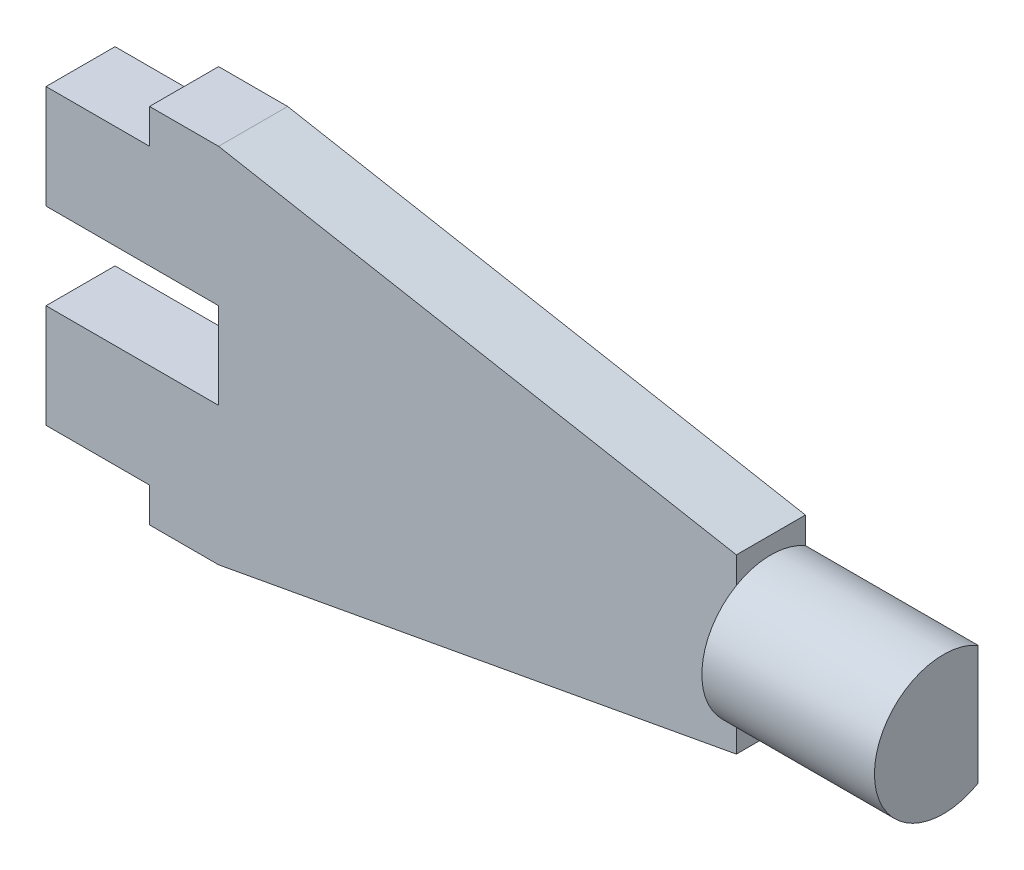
ISO-10303-21;
HEADER;
FILE_DESCRIPTION(('STEP AP214'),'2;1');
FILE_NAME('part.step','',(''),(''),'','','');
FILE_SCHEMA(('AUTOMOTIVE_DESIGN { 1 0 10303 214 1 1 1 1 }'));
ENDSEC;
DATA;
#1=APPLICATION_CONTEXT('core data for automotive mechanical design processes');
#2=APPLICATION_PROTOCOL_DEFINITION('international standard','automotive_design',2000,#1);
#3=PRODUCT_CONTEXT('',#1,'mechanical');
#4=PRODUCT('Part','Part','',(#3));
#5=PRODUCT_RELATED_PRODUCT_CATEGORY('part','',(#4));
#6=PRODUCT_DEFINITION_FORMATION('','',#4);
#7=PRODUCT_DEFINITION_CONTEXT('part definition',#1,'design');
#8=PRODUCT_DEFINITION('design','',#6,#7);
#9=PRODUCT_DEFINITION_SHAPE('','',#8);
#10=(LENGTH_UNIT() NAMED_UNIT(*) SI_UNIT(.MILLI.,.METRE.));
#11=(NAMED_UNIT(*) PLANE_ANGLE_UNIT() SI_UNIT($,.RADIAN.));
#12=(NAMED_UNIT(*) SI_UNIT($,.STERADIAN.) SOLID_ANGLE_UNIT());
#13=UNCERTAINTY_MEASURE_WITH_UNIT(LENGTH_MEASURE(1.E-05),#10,'distance_accuracy_value','');
#14=(GEOMETRIC_REPRESENTATION_CONTEXT(3) GLOBAL_UNCERTAINTY_ASSIGNED_CONTEXT((#13)) GLOBAL_UNIT_ASSIGNED_CONTEXT((#10,
#11,#12)) REPRESENTATION_CONTEXT('',''));
#15=CARTESIAN_POINT('',(0.,0.,0.));
#16=DIRECTION('',(0.,0.,1.));
#17=DIRECTION('',(1.,0.,0.));
#18=AXIS2_PLACEMENT_3D('',#15,#16,#17);
#19=CARTESIAN_POINT('',(25.,2.5,2.));
#20=DIRECTION('',(-1.,0.,0.));
#21=DIRECTION('',(0.,0.,1.));
#22=AXIS2_PLACEMENT_3D('',#19,#20,#21);
#23=PLANE('',#22);
#24=CARTESIAN_POINT('',(25.,0.,1.));
#25=DIRECTION('',(1.,0.,0.));
#26=DIRECTION('',(0.,0.,-1.));
#27=AXIS2_PLACEMENT_3D('',#24,#25,#26);
#28=CIRCLE('',#27,2.);
#29=CARTESIAN_POINT('',(25.,1.73205080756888,0.));
#30=VERTEX_POINT('',#29);
#31=CARTESIAN_POINT('',(25.,-1.73205080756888,0.));
#32=VERTEX_POINT('',#31);
#33=EDGE_CURVE('E171',#30,#32,#28,.T.);
#34=ORIENTED_EDGE('',*,*,#33,.T.);
#35=DIRECTION('',(0.,1.,0.));
#36=VECTOR('',#35,1.);
#37=CARTESIAN_POINT('',(25.,2.5,0.));
#38=LINE('',#37,#36);
#39=EDGE_CURVE('E177',#32,#30,#38,.T.);
#40=ORIENTED_EDGE('',*,*,#39,.T.);
#41=EDGE_LOOP('',(#34,#40));
#42=FACE_BOUND('',#41,.T.);
#43=ADVANCED_FACE('F34',(#42),#23,.F.);
#44=CARTESIAN_POINT('',(0.,0.,0.));
#45=DIRECTION('',(0.,0.,-1.));
#46=DIRECTION('',(-1.,0.,0.));
#47=AXIS2_PLACEMENT_3D('',#44,#45,#46);
#48=PLANE('',#47);
#49=DIRECTION('',(1.,0.,0.));
#50=VECTOR('',#49,1.);
#51=CARTESIAN_POINT('',(20.,-1.73205080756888,0.));
#52=LINE('',#51,#50);
#53=CARTESIAN_POINT('',(20.,-1.73205080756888,0.));
#54=VERTEX_POINT('',#53);
#55=EDGE_CURVE('E166',#54,#32,#52,.T.);
#56=ORIENTED_EDGE('',*,*,#55,.F.);
#57=DIRECTION('',(0.,-1.,0.));
#58=VECTOR('',#57,1.);
#59=CARTESIAN_POINT('',(20.,0.,0.));
#60=LINE('',#59,#58);
#61=CARTESIAN_POINT('',(20.,-2.5,0.));
#62=VERTEX_POINT('',#61);
#63=EDGE_CURVE('E152',#54,#62,#60,.T.);
#64=ORIENTED_EDGE('',*,*,#63,.T.);
#65=DIRECTION('',(0.983606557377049,0.180327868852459,0.));
#66=VECTOR('',#65,1.);
#67=CARTESIAN_POINT('',(5.,-5.25,0.));
#68=LINE('',#67,#66);
#69=CARTESIAN_POINT('',(5.,-5.25,0.));
#70=VERTEX_POINT('',#69);
#71=EDGE_CURVE('E215',#70,#62,#68,.T.);
#72=ORIENTED_EDGE('',*,*,#71,.F.);
#73=DIRECTION('',(1.,0.,0.));
#74=VECTOR('',#73,1.);
#75=CARTESIAN_POINT('',(3.,-5.25,0.));
#76=LINE('',#75,#74);
#77=CARTESIAN_POINT('',(3.,-5.25,0.));
#78=VERTEX_POINT('',#77);
#79=EDGE_CURVE('E251',#78,#70,#76,.T.);
#80=ORIENTED_EDGE('',*,*,#79,.F.);
#81=DIRECTION('',(0.,-1.,0.));
#82=VECTOR('',#81,1.);
#83=CARTESIAN_POINT('',(3.,-4.25,0.));
#84=LINE('',#83,#82);
#85=CARTESIAN_POINT('',(3.,-4.25,0.));
#86=VERTEX_POINT('',#85);
#87=EDGE_CURVE('E249',#86,#78,#84,.T.);
#88=ORIENTED_EDGE('',*,*,#87,.F.);
#89=DIRECTION('',(1.,0.,0.));
#90=VECTOR('',#89,1.);
#91=CARTESIAN_POINT('',(0.,-4.25,0.));
#92=LINE('',#91,#90);
#93=CARTESIAN_POINT('',(0.,-4.25,0.));
#94=VERTEX_POINT('',#93);
#95=EDGE_CURVE('E247',#94,#86,#92,.T.);
#96=ORIENTED_EDGE('',*,*,#95,.F.);
#97=DIRECTION('',(0.,-1.,0.));
#98=VECTOR('',#97,1.);
#99=CARTESIAN_POINT('',(0.,-4.25,0.));
#100=LINE('',#99,#98);
#101=CARTESIAN_POINT('',(0.,-1.25,0.));
#102=VERTEX_POINT('',#101);
#103=EDGE_CURVE('E243',#102,#94,#100,.T.);
#104=ORIENTED_EDGE('',*,*,#103,.F.);
#105=DIRECTION('',(1.,0.,0.));
#106=VECTOR('',#105,1.);
#107=CARTESIAN_POINT('',(0.,-1.25,0.));
#108=LINE('',#107,#106);
#109=CARTESIAN_POINT('',(5.,-1.25,0.));
#110=VERTEX_POINT('',#109);
#111=EDGE_CURVE('E189',#102,#110,#108,.T.);
#112=ORIENTED_EDGE('',*,*,#111,.T.);
#113=DIRECTION('',(0.,1.,0.));
#114=VECTOR('',#113,1.);
#115=CARTESIAN_POINT('',(5.,1.25,0.));
#116=LINE('',#115,#114);
#117=CARTESIAN_POINT('',(5.,1.25,0.));
#118=VERTEX_POINT('',#117);
#119=EDGE_CURVE('E56',#110,#118,#116,.T.);
#120=ORIENTED_EDGE('',*,*,#119,.T.);
#121=DIRECTION('',(-1.,0.,0.));
#122=VECTOR('',#121,1.);
#123=CARTESIAN_POINT('',(0.,1.25,0.));
#124=LINE('',#123,#122);
#125=CARTESIAN_POINT('',(0.,1.25,0.));
#126=VERTEX_POINT('',#125);
#127=EDGE_CURVE('E194',#118,#126,#124,.T.);
#128=ORIENTED_EDGE('',*,*,#127,.T.);
#129=CARTESIAN_POINT('',(0.,4.25,0.));
#130=VERTEX_POINT('',#129);
#131=EDGE_CURVE('E244',#130,#126,#100,.T.);
#132=ORIENTED_EDGE('',*,*,#131,.F.);
#133=DIRECTION('',(-1.,0.,0.));
#134=VECTOR('',#133,1.);
#135=CARTESIAN_POINT('',(0.,4.25,0.));
#136=LINE('',#135,#134);
#137=CARTESIAN_POINT('',(3.,4.25,0.));
#138=VERTEX_POINT('',#137);
#139=EDGE_CURVE('E241',#138,#130,#136,.T.);
#140=ORIENTED_EDGE('',*,*,#139,.F.);
#141=DIRECTION('',(0.,-1.,0.));
#142=VECTOR('',#141,1.);
#143=CARTESIAN_POINT('',(3.,4.25,0.));
#144=LINE('',#143,#142);
#145=CARTESIAN_POINT('',(3.,5.25,0.));
#146=VERTEX_POINT('',#145);
#147=EDGE_CURVE('E239',#146,#138,#144,.T.);
#148=ORIENTED_EDGE('',*,*,#147,.F.);
#149=DIRECTION('',(-1.,0.,0.));
#150=VECTOR('',#149,1.);
#151=CARTESIAN_POINT('',(3.,5.25,0.));
#152=LINE('',#151,#150);
#153=CARTESIAN_POINT('',(5.,5.25,0.));
#154=VERTEX_POINT('',#153);
#155=EDGE_CURVE('E237',#154,#146,#152,.T.);
#156=ORIENTED_EDGE('',*,*,#155,.F.);
#157=DIRECTION('',(-0.983606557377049,0.180327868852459,0.));
#158=VECTOR('',#157,1.);
#159=CARTESIAN_POINT('',(5.,5.25,0.));
#160=LINE('',#159,#158);
#161=CARTESIAN_POINT('',(20.,2.5,0.));
#162=VERTEX_POINT('',#161);
#163=EDGE_CURVE('E235',#162,#154,#160,.T.);
#164=ORIENTED_EDGE('',*,*,#163,.F.);
#165=CARTESIAN_POINT('',(20.,1.73205080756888,0.));
#166=VERTEX_POINT('',#165);
#167=EDGE_CURVE('E163',#162,#166,#60,.T.);
#168=ORIENTED_EDGE('',*,*,#167,.T.);
#169=DIRECTION('',(1.,0.,0.));
#170=VECTOR('',#169,1.);
#171=CARTESIAN_POINT('',(20.,1.73205080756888,0.));
#172=LINE('',#171,#170);
#173=EDGE_CURVE('E178',#166,#30,#172,.T.);
#174=ORIENTED_EDGE('',*,*,#173,.T.);
#175=ORIENTED_EDGE('',*,*,#39,.F.);
#176=EDGE_LOOP('',(#56,#64,#72,#80,#88,#96,#104,#112,#120,#128,#132,#140,#148,#156,#164,#168,
#174,#175));
#177=FACE_BOUND('',#176,.T.);
#178=ADVANCED_FACE('F174',(#177),#48,.T.);
#179=CARTESIAN_POINT('',(20.,-2.5,6.));
#180=DIRECTION('',(1.,0.,0.));
#181=DIRECTION('',(0.,0.,-1.));
#182=AXIS2_PLACEMENT_3D('',#179,#180,#181);
#183=PLANE('',#182);
#184=CARTESIAN_POINT('',(20.,0.,1.));
#185=DIRECTION('',(1.,0.,0.));
#186=DIRECTION('',(0.,0.,-1.));
#187=AXIS2_PLACEMENT_3D('',#184,#185,#186);
#188=CIRCLE('',#187,2.);
#189=CARTESIAN_POINT('',(20.,1.73205080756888,2.));
#190=VERTEX_POINT('',#189);
#191=CARTESIAN_POINT('',(20.,-1.73205080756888,2.));
#192=VERTEX_POINT('',#191);
#193=EDGE_CURVE('E169',#190,#192,#188,.T.);
#194=ORIENTED_EDGE('',*,*,#193,.F.);
#195=DIRECTION('',(0.,-1.,0.));
#196=VECTOR('',#195,1.);
#197=CARTESIAN_POINT('',(20.,-2.5,2.));
#198=LINE('',#197,#196);
#199=EDGE_CURVE('E162',#190,#192,#198,.T.);
#200=ORIENTED_EDGE('',*,*,#199,.T.);
#201=EDGE_LOOP('',(#194,#200));
#202=FACE_BOUND('',#201,.T.);
#203=ADVANCED_FACE('F310',(#202),#183,.F.);
#204=CARTESIAN_POINT('',(0.,0.,2.));
#205=DIRECTION('',(0.,0.,-1.));
#206=DIRECTION('',(-1.,0.,0.));
#207=AXIS2_PLACEMENT_3D('',#204,#205,#206);
#208=PLANE('',#207);
#209=CARTESIAN_POINT('',(20.,2.5,2.));
#210=VERTEX_POINT('',#209);
#211=EDGE_CURVE('E186',#210,#190,#198,.T.);
#212=ORIENTED_EDGE('',*,*,#211,.F.);
#213=DIRECTION('',(-0.983606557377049,0.180327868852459,0.));
#214=VECTOR('',#213,1.);
#215=CARTESIAN_POINT('',(5.,5.25,2.));
#216=LINE('',#215,#214);
#217=CARTESIAN_POINT('',(5.,5.25,2.));
#218=VERTEX_POINT('',#217);
#219=EDGE_CURVE('E212',#210,#218,#216,.T.);
#220=ORIENTED_EDGE('',*,*,#219,.T.);
#221=DIRECTION('',(-1.,0.,0.));
#222=VECTOR('',#221,1.);
#223=CARTESIAN_POINT('',(3.,5.25,2.));
#224=LINE('',#223,#222);
#225=CARTESIAN_POINT('',(3.,5.25,2.));
#226=VERTEX_POINT('',#225);
#227=EDGE_CURVE('E214',#218,#226,#224,.T.);
#228=ORIENTED_EDGE('',*,*,#227,.T.);
#229=DIRECTION('',(0.,-1.,0.));
#230=VECTOR('',#229,1.);
#231=CARTESIAN_POINT('',(3.,4.25,2.));
#232=LINE('',#231,#230);
#233=CARTESIAN_POINT('',(3.,4.25,2.));
#234=VERTEX_POINT('',#233);
#235=EDGE_CURVE('E217',#226,#234,#232,.T.);
#236=ORIENTED_EDGE('',*,*,#235,.T.);
#237=DIRECTION('',(-1.,0.,0.));
#238=VECTOR('',#237,1.);
#239=CARTESIAN_POINT('',(0.,4.25,2.));
#240=LINE('',#239,#238);
#241=CARTESIAN_POINT('',(0.,4.25,2.));
#242=VERTEX_POINT('',#241);
#243=EDGE_CURVE('E219',#234,#242,#240,.T.);
#244=ORIENTED_EDGE('',*,*,#243,.T.);
#245=DIRECTION('',(0.,-1.,0.));
#246=VECTOR('',#245,1.);
#247=CARTESIAN_POINT('',(0.,-4.25,2.));
#248=LINE('',#247,#246);
#249=CARTESIAN_POINT('',(0.,1.25,2.));
#250=VERTEX_POINT('',#249);
#251=EDGE_CURVE('E222',#242,#250,#248,.T.);
#252=ORIENTED_EDGE('',*,*,#251,.T.);
#253=DIRECTION('',(-1.,0.,0.));
#254=VECTOR('',#253,1.);
#255=CARTESIAN_POINT('',(0.,1.25,2.));
#256=LINE('',#255,#254);
#257=CARTESIAN_POINT('',(5.,1.25,2.));
#258=VERTEX_POINT('',#257);
#259=EDGE_CURVE('E192',#258,#250,#256,.T.);
#260=ORIENTED_EDGE('',*,*,#259,.F.);
#261=DIRECTION('',(0.,1.,0.));
#262=VECTOR('',#261,1.);
#263=CARTESIAN_POINT('',(5.,1.25,2.));
#264=LINE('',#263,#262);
#265=CARTESIAN_POINT('',(5.,-1.25,2.));
#266=VERTEX_POINT('',#265);
#267=EDGE_CURVE('E200',#266,#258,#264,.T.);
#268=ORIENTED_EDGE('',*,*,#267,.F.);
#269=DIRECTION('',(1.,0.,0.));
#270=VECTOR('',#269,1.);
#271=CARTESIAN_POINT('',(0.,-1.25,2.));
#272=LINE('',#271,#270);
#273=CARTESIAN_POINT('',(0.,-1.25,2.));
#274=VERTEX_POINT('',#273);
#275=EDGE_CURVE('E188',#274,#266,#272,.T.);
#276=ORIENTED_EDGE('',*,*,#275,.F.);
#277=CARTESIAN_POINT('',(0.,-4.25,2.));
#278=VERTEX_POINT('',#277);
#279=EDGE_CURVE('E221',#274,#278,#248,.T.);
#280=ORIENTED_EDGE('',*,*,#279,.T.);
#281=DIRECTION('',(1.,0.,0.));
#282=VECTOR('',#281,1.);
#283=CARTESIAN_POINT('',(0.,-4.25,2.));
#284=LINE('',#283,#282);
#285=CARTESIAN_POINT('',(3.,-4.25,2.));
#286=VERTEX_POINT('',#285);
#287=EDGE_CURVE('E225',#278,#286,#284,.T.);
#288=ORIENTED_EDGE('',*,*,#287,.T.);
#289=DIRECTION('',(0.,-1.,0.));
#290=VECTOR('',#289,1.);
#291=CARTESIAN_POINT('',(3.,-4.25,2.));
#292=LINE('',#291,#290);
#293=CARTESIAN_POINT('',(3.,-5.25,2.));
#294=VERTEX_POINT('',#293);
#295=EDGE_CURVE('E227',#286,#294,#292,.T.);
#296=ORIENTED_EDGE('',*,*,#295,.T.);
#297=DIRECTION('',(1.,0.,0.));
#298=VECTOR('',#297,1.);
#299=CARTESIAN_POINT('',(3.,-5.25,2.));
#300=LINE('',#299,#298);
#301=CARTESIAN_POINT('',(5.,-5.25,2.));
#302=VERTEX_POINT('',#301);
#303=EDGE_CURVE('E229',#294,#302,#300,.T.);
#304=ORIENTED_EDGE('',*,*,#303,.T.);
#305=DIRECTION('',(0.983606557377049,0.180327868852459,0.));
#306=VECTOR('',#305,1.);
#307=CARTESIAN_POINT('',(5.,-5.25,2.));
#308=LINE('',#307,#306);
#309=CARTESIAN_POINT('',(20.,-2.5,2.));
#310=VERTEX_POINT('',#309);
#311=EDGE_CURVE('E231',#302,#310,#308,.T.);
#312=ORIENTED_EDGE('',*,*,#311,.T.);
#313=DIRECTION('',(0.,-1.,0.));
#314=VECTOR('',#313,1.);
#315=CARTESIAN_POINT('',(20.,0.,2.));
#316=LINE('',#315,#314);
#317=EDGE_CURVE('E180',#192,#310,#316,.T.);
#318=ORIENTED_EDGE('',*,*,#317,.F.);
#319=ORIENTED_EDGE('',*,*,#199,.F.);
#320=EDGE_LOOP('',(#212,#220,#228,#236,#244,#252,#260,#268,#276,#280,#288,#296,#304,#312,#318,#319));
#321=FACE_BOUND('',#320,.T.);
#322=ADVANCED_FACE('F299',(#321),#208,.F.);
#323=CARTESIAN_POINT('',(0.,-4.25,2.));
#324=DIRECTION('',(1.,0.,0.));
#325=DIRECTION('',(0.,0.,-1.));
#326=AXIS2_PLACEMENT_3D('',#323,#324,#325);
#327=PLANE('',#326);
#328=ORIENTED_EDGE('',*,*,#131,.T.);
#329=DIRECTION('',(0.,0.,1.));
#330=VECTOR('',#329,1.);
#331=CARTESIAN_POINT('',(0.,1.25,0.));
#332=LINE('',#331,#330);
#333=EDGE_CURVE('E204',#126,#250,#332,.T.);
#334=ORIENTED_EDGE('',*,*,#333,.T.);
#335=ORIENTED_EDGE('',*,*,#251,.F.);
#336=DIRECTION('',(0.,0.,-1.));
#337=VECTOR('',#336,1.);
#338=CARTESIAN_POINT('',(0.,4.25,2.));
#339=LINE('',#338,#337);
#340=EDGE_CURVE('E267',#242,#130,#339,.T.);
#341=ORIENTED_EDGE('',*,*,#340,.T.);
#342=EDGE_LOOP('',(#328,#334,#335,#341));
#343=FACE_BOUND('',#342,.T.);
#344=ADVANCED_FACE('F341',(#343),#327,.F.);
#345=CARTESIAN_POINT('',(5.,5.25,2.));
#346=DIRECTION('',(-0.180327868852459,-0.983606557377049,0.));
#347=DIRECTION('',(0.983606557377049,-0.180327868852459,0.));
#348=AXIS2_PLACEMENT_3D('',#345,#346,#347);
#349=PLANE('',#348);
#350=ORIENTED_EDGE('',*,*,#163,.T.);
#351=DIRECTION('',(0.,0.,-1.));
#352=VECTOR('',#351,1.);
#353=CARTESIAN_POINT('',(5.,5.25,2.));
#354=LINE('',#353,#352);
#355=EDGE_CURVE('E41',#218,#154,#354,.T.);
#356=ORIENTED_EDGE('',*,*,#355,.F.);
#357=ORIENTED_EDGE('',*,*,#219,.F.);
#358=DIRECTION('',(0.,0.,-1.));
#359=VECTOR('',#358,1.);
#360=CARTESIAN_POINT('',(20.,2.5,2.));
#361=LINE('',#360,#359);
#362=EDGE_CURVE('E12',#210,#162,#361,.T.);
#363=ORIENTED_EDGE('',*,*,#362,.T.);
#364=EDGE_LOOP('',(#350,#356,#357,#363));
#365=FACE_BOUND('',#364,.T.);
#366=ADVANCED_FACE('F302',(#365),#349,.F.);
#367=CARTESIAN_POINT('',(3.,5.25,2.));
#368=DIRECTION('',(0.,-1.,0.));
#369=DIRECTION('',(0.,0.,-1.));
#370=AXIS2_PLACEMENT_3D('',#367,#368,#369);
#371=PLANE('',#370);
#372=ORIENTED_EDGE('',*,*,#155,.T.);
#373=DIRECTION('',(0.,0.,-1.));
#374=VECTOR('',#373,1.);
#375=CARTESIAN_POINT('',(3.,5.25,2.));
#376=LINE('',#375,#374);
#377=EDGE_CURVE('E273',#226,#146,#376,.T.);
#378=ORIENTED_EDGE('',*,*,#377,.F.);
#379=ORIENTED_EDGE('',*,*,#227,.F.);
#380=ORIENTED_EDGE('',*,*,#355,.T.);
#381=EDGE_LOOP('',(#372,#378,#379,#380));
#382=FACE_BOUND('',#381,.T.);
#383=ADVANCED_FACE('F280',(#382),#371,.F.);
#384=CARTESIAN_POINT('',(3.,4.25,2.));
#385=DIRECTION('',(1.,0.,0.));
#386=DIRECTION('',(0.,0.,-1.));
#387=AXIS2_PLACEMENT_3D('',#384,#385,#386);
#388=PLANE('',#387);
#389=ORIENTED_EDGE('',*,*,#147,.T.);
#390=DIRECTION('',(0.,0.,-1.));
#391=VECTOR('',#390,1.);
#392=CARTESIAN_POINT('',(3.,4.25,2.));
#393=LINE('',#392,#391);
#394=EDGE_CURVE('E270',#234,#138,#393,.T.);
#395=ORIENTED_EDGE('',*,*,#394,.F.);
#396=ORIENTED_EDGE('',*,*,#235,.F.);
#397=ORIENTED_EDGE('',*,*,#377,.T.);
#398=EDGE_LOOP('',(#389,#395,#396,#397));
#399=FACE_BOUND('',#398,.T.);
#400=ADVANCED_FACE('F290',(#399),#388,.F.);
#401=CARTESIAN_POINT('',(0.,4.25,2.));
#402=DIRECTION('',(0.,-1.,0.));
#403=DIRECTION('',(0.,0.,-1.));
#404=AXIS2_PLACEMENT_3D('',#401,#402,#403);
#405=PLANE('',#404);
#406=ORIENTED_EDGE('',*,*,#139,.T.);
#407=ORIENTED_EDGE('',*,*,#340,.F.);
#408=ORIENTED_EDGE('',*,*,#243,.F.);
#409=ORIENTED_EDGE('',*,*,#394,.T.);
#410=EDGE_LOOP('',(#406,#407,#408,#409));
#411=FACE_BOUND('',#410,.T.);
#412=ADVANCED_FACE('F294',(#411),#405,.F.);
#413=ORIENTED_EDGE('',*,*,#279,.F.);
#414=DIRECTION('',(0.,0.,1.));
#415=VECTOR('',#414,1.);
#416=CARTESIAN_POINT('',(0.,-1.25,0.));
#417=LINE('',#416,#415);
#418=EDGE_CURVE('E197',#102,#274,#417,.T.);
#419=ORIENTED_EDGE('',*,*,#418,.F.);
#420=ORIENTED_EDGE('',*,*,#103,.T.);
#421=DIRECTION('',(0.,0.,-1.));
#422=VECTOR('',#421,1.);
#423=CARTESIAN_POINT('',(0.,-4.25,2.));
#424=LINE('',#423,#422);
#425=EDGE_CURVE('E264',#278,#94,#424,.T.);
#426=ORIENTED_EDGE('',*,*,#425,.F.);
#427=EDGE_LOOP('',(#413,#419,#420,#426));
#428=FACE_BOUND('',#427,.T.);
#429=ADVANCED_FACE('F336',(#428),#327,.F.);
#430=CARTESIAN_POINT('',(0.,-4.25,2.));
#431=DIRECTION('',(0.,1.,0.));
#432=DIRECTION('',(0.,0.,1.));
#433=AXIS2_PLACEMENT_3D('',#430,#431,#432);
#434=PLANE('',#433);
#435=ORIENTED_EDGE('',*,*,#95,.T.);
#436=DIRECTION('',(0.,0.,-1.));
#437=VECTOR('',#436,1.);
#438=CARTESIAN_POINT('',(3.,-4.25,2.));
#439=LINE('',#438,#437);
#440=EDGE_CURVE('E261',#286,#86,#439,.T.);
#441=ORIENTED_EDGE('',*,*,#440,.F.);
#442=ORIENTED_EDGE('',*,*,#287,.F.);
#443=ORIENTED_EDGE('',*,*,#425,.T.);
#444=EDGE_LOOP('',(#435,#441,#442,#443));
#445=FACE_BOUND('',#444,.T.);
#446=ADVANCED_FACE('F332',(#445),#434,.F.);
#447=CARTESIAN_POINT('',(3.,-4.25,2.));
#448=DIRECTION('',(1.,0.,0.));
#449=DIRECTION('',(0.,0.,-1.));
#450=AXIS2_PLACEMENT_3D('',#447,#448,#449);
#451=PLANE('',#450);
#452=ORIENTED_EDGE('',*,*,#87,.T.);
#453=DIRECTION('',(0.,0.,-1.));
#454=VECTOR('',#453,1.);
#455=CARTESIAN_POINT('',(3.,-5.25,2.));
#456=LINE('',#455,#454);
#457=EDGE_CURVE('E258',#294,#78,#456,.T.);
#458=ORIENTED_EDGE('',*,*,#457,.F.);
#459=ORIENTED_EDGE('',*,*,#295,.F.);
#460=ORIENTED_EDGE('',*,*,#440,.T.);
#461=EDGE_LOOP('',(#452,#458,#459,#460));
#462=FACE_BOUND('',#461,.T.);
#463=ADVANCED_FACE('F328',(#462),#451,.F.);
#464=CARTESIAN_POINT('',(3.,-5.25,2.));
#465=DIRECTION('',(0.,1.,0.));
#466=DIRECTION('',(0.,0.,1.));
#467=AXIS2_PLACEMENT_3D('',#464,#465,#466);
#468=PLANE('',#467);
#469=ORIENTED_EDGE('',*,*,#79,.T.);
#470=DIRECTION('',(0.,0.,-1.));
#471=VECTOR('',#470,1.);
#472=CARTESIAN_POINT('',(5.,-5.25,2.));
#473=LINE('',#472,#471);
#474=EDGE_CURVE('E255',#302,#70,#473,.T.);
#475=ORIENTED_EDGE('',*,*,#474,.F.);
#476=ORIENTED_EDGE('',*,*,#303,.F.);
#477=ORIENTED_EDGE('',*,*,#457,.T.);
#478=EDGE_LOOP('',(#469,#475,#476,#477));
#479=FACE_BOUND('',#478,.T.);
#480=ADVANCED_FACE('F324',(#479),#468,.F.);
#481=CARTESIAN_POINT('',(5.,-5.25,2.));
#482=DIRECTION('',(-0.180327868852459,0.983606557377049,0.));
#483=DIRECTION('',(-0.983606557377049,-0.180327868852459,0.));
#484=AXIS2_PLACEMENT_3D('',#481,#482,#483);
#485=PLANE('',#484);
#486=ORIENTED_EDGE('',*,*,#71,.T.);
#487=DIRECTION('',(0.,0.,-1.));
#488=VECTOR('',#487,1.);
#489=CARTESIAN_POINT('',(20.,-2.5,2.));
#490=LINE('',#489,#488);
#491=EDGE_CURVE('E157',#310,#62,#490,.T.);
#492=ORIENTED_EDGE('',*,*,#491,.F.);
#493=ORIENTED_EDGE('',*,*,#311,.F.);
#494=ORIENTED_EDGE('',*,*,#474,.T.);
#495=EDGE_LOOP('',(#486,#492,#493,#494));
#496=FACE_BOUND('',#495,.T.);
#497=ADVANCED_FACE('F320',(#496),#485,.F.);
#498=CARTESIAN_POINT('',(0.,1.25,0.));
#499=DIRECTION('',(0.,1.,0.));
#500=DIRECTION('',(0.,0.,1.));
#501=AXIS2_PLACEMENT_3D('',#498,#499,#500);
#502=PLANE('',#501);
#503=ORIENTED_EDGE('',*,*,#259,.T.);
#504=ORIENTED_EDGE('',*,*,#333,.F.);
#505=ORIENTED_EDGE('',*,*,#127,.F.);
#506=DIRECTION('',(0.,0.,1.));
#507=VECTOR('',#506,1.);
#508=CARTESIAN_POINT('',(5.,1.25,0.));
#509=LINE('',#508,#507);
#510=EDGE_CURVE('E207',#118,#258,#509,.T.);
#511=ORIENTED_EDGE('',*,*,#510,.T.);
#512=EDGE_LOOP('',(#503,#504,#505,#511));
#513=FACE_BOUND('',#512,.T.);
#514=ADVANCED_FACE('F323',(#513),#502,.F.);
#515=CARTESIAN_POINT('',(5.,1.25,0.));
#516=DIRECTION('',(1.,0.,0.));
#517=DIRECTION('',(0.,0.,-1.));
#518=AXIS2_PLACEMENT_3D('',#515,#516,#517);
#519=PLANE('',#518);
#520=ORIENTED_EDGE('',*,*,#267,.T.);
#521=ORIENTED_EDGE('',*,*,#510,.F.);
#522=ORIENTED_EDGE('',*,*,#119,.F.);
#523=DIRECTION('',(0.,0.,1.));
#524=VECTOR('',#523,1.);
#525=CARTESIAN_POINT('',(5.,-1.25,0.));
#526=LINE('',#525,#524);
#527=EDGE_CURVE('E209',#110,#266,#526,.T.);
#528=ORIENTED_EDGE('',*,*,#527,.T.);
#529=EDGE_LOOP('',(#520,#521,#522,#528));
#530=FACE_BOUND('',#529,.T.);
#531=ADVANCED_FACE('F360',(#530),#519,.F.);
#532=CARTESIAN_POINT('',(0.,-1.25,0.));
#533=DIRECTION('',(0.,-1.,0.));
#534=DIRECTION('',(0.,0.,-1.));
#535=AXIS2_PLACEMENT_3D('',#532,#533,#534);
#536=PLANE('',#535);
#537=ORIENTED_EDGE('',*,*,#275,.T.);
#538=ORIENTED_EDGE('',*,*,#527,.F.);
#539=ORIENTED_EDGE('',*,*,#111,.F.);
#540=ORIENTED_EDGE('',*,*,#418,.T.);
#541=EDGE_LOOP('',(#537,#538,#539,#540));
#542=FACE_BOUND('',#541,.T.);
#543=ADVANCED_FACE('F362',(#542),#536,.F.);
#544=CARTESIAN_POINT('',(20.,0.,3.));
#545=DIRECTION('',(1.,0.,0.));
#546=DIRECTION('',(0.,0.,-1.));
#547=AXIS2_PLACEMENT_3D('',#544,#545,#546);
#548=PLANE('',#547);
#549=ORIENTED_EDGE('',*,*,#211,.T.);
#550=EDGE_CURVE('E48',#166,#190,#188,.T.);
#551=ORIENTED_EDGE('',*,*,#550,.F.);
#552=ORIENTED_EDGE('',*,*,#167,.F.);
#553=ORIENTED_EDGE('',*,*,#362,.F.);
#554=EDGE_LOOP('',(#549,#551,#552,#553));
#555=FACE_BOUND('',#554,.T.);
#556=ADVANCED_FACE('F304',(#555),#548,.T.);
#557=ORIENTED_EDGE('',*,*,#491,.T.);
#558=ORIENTED_EDGE('',*,*,#63,.F.);
#559=EDGE_CURVE('E155',#192,#54,#188,.T.);
#560=ORIENTED_EDGE('',*,*,#559,.F.);
#561=ORIENTED_EDGE('',*,*,#317,.T.);
#562=EDGE_LOOP('',(#557,#558,#560,#561));
#563=FACE_BOUND('',#562,.T.);
#564=ADVANCED_FACE('F154',(#563),#548,.T.);
#565=CARTESIAN_POINT('',(20.,0.,1.));
#566=DIRECTION('',(1.,0.,0.));
#567=DIRECTION('',(0.,0.,-1.));
#568=AXIS2_PLACEMENT_3D('',#565,#566,#567);
#569=CYLINDRICAL_SURFACE('',#568,2.);
#570=ORIENTED_EDGE('',*,*,#33,.F.);
#571=ORIENTED_EDGE('',*,*,#173,.F.);
#572=ORIENTED_EDGE('',*,*,#550,.T.);
#573=ORIENTED_EDGE('',*,*,#193,.T.);
#574=ORIENTED_EDGE('',*,*,#559,.T.);
#575=ORIENTED_EDGE('',*,*,#55,.T.);
#576=EDGE_LOOP('',(#570,#571,#572,#573,#574,#575));
#577=FACE_BOUND('',#576,.T.);
#578=ADVANCED_FACE('F165',(#577),#569,.T.);
#579=CLOSED_SHELL('',(#43,#178,#203,#322,#344,#366,#383,#400,#412,#429,#446,#463,#480,#497,#514,
#531,#543,#556,#564,#578));
#580=MANIFOLD_SOLID_BREP('B2',#579);
#581=ADVANCED_BREP_SHAPE_REPRESENTATION('',(#18,#580),#14);
#582=SHAPE_DEFINITION_REPRESENTATION(#9,#581);
ENDSEC;
END-ISO-10303-21;
